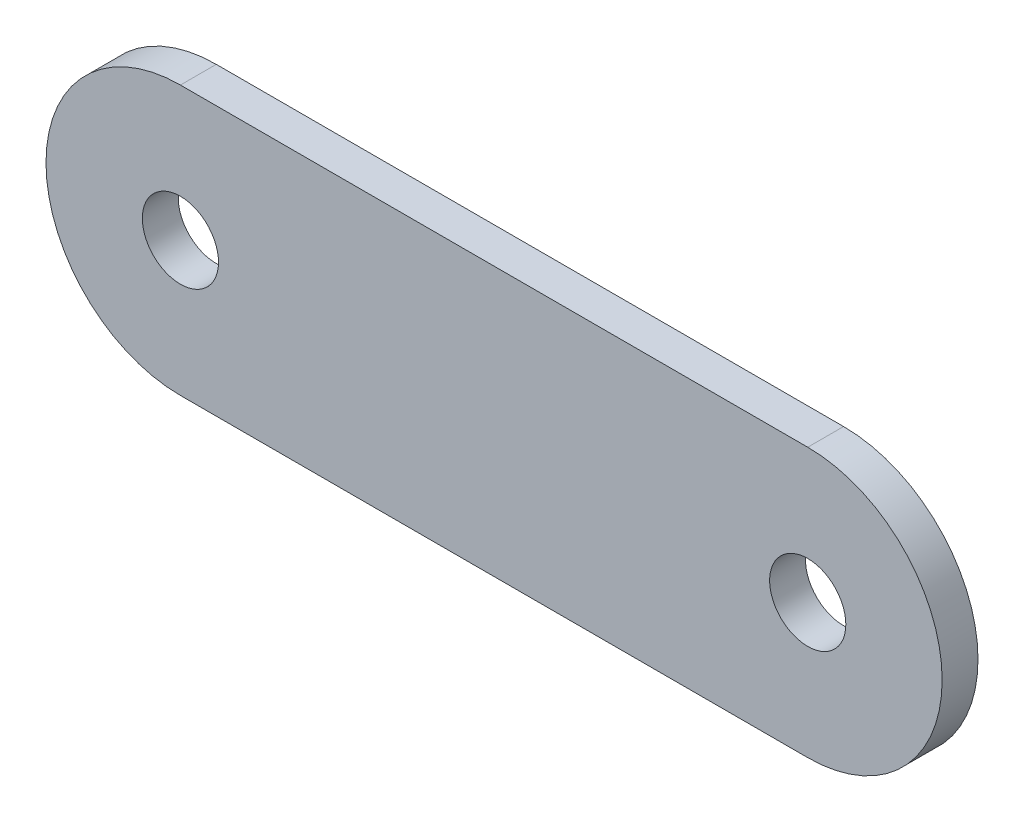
from build123d import *

# Parameters (mm, degrees)
ESQUISSE1_R        = 2.125
BOSS_EXTRU_1_DEPTH = 2


with BuildPart() as part:
    # Esquisse1 → Boss.-Extru.1 (new body)
    with BuildSketch(Plane.XY):
        with BuildLine():
            Line((0, 7.5), (35, 7.5))
            ThreePointArc((35, 7.5), (42.5, 0), (35, -7.5))
            Line((35, -7.5), (0, -7.5))
            ThreePointArc((0, -7.5), (-7.5, 0), (0, 7.5))
        make_face()
        Circle(ESQUISSE1_R, mode=Mode.SUBTRACT)
        with Locations((35, 0)):
            Circle(ESQUISSE1_R, mode=Mode.SUBTRACT)
    extrude(amount=BOSS_EXTRU_1_DEPTH)


solid = part.part
